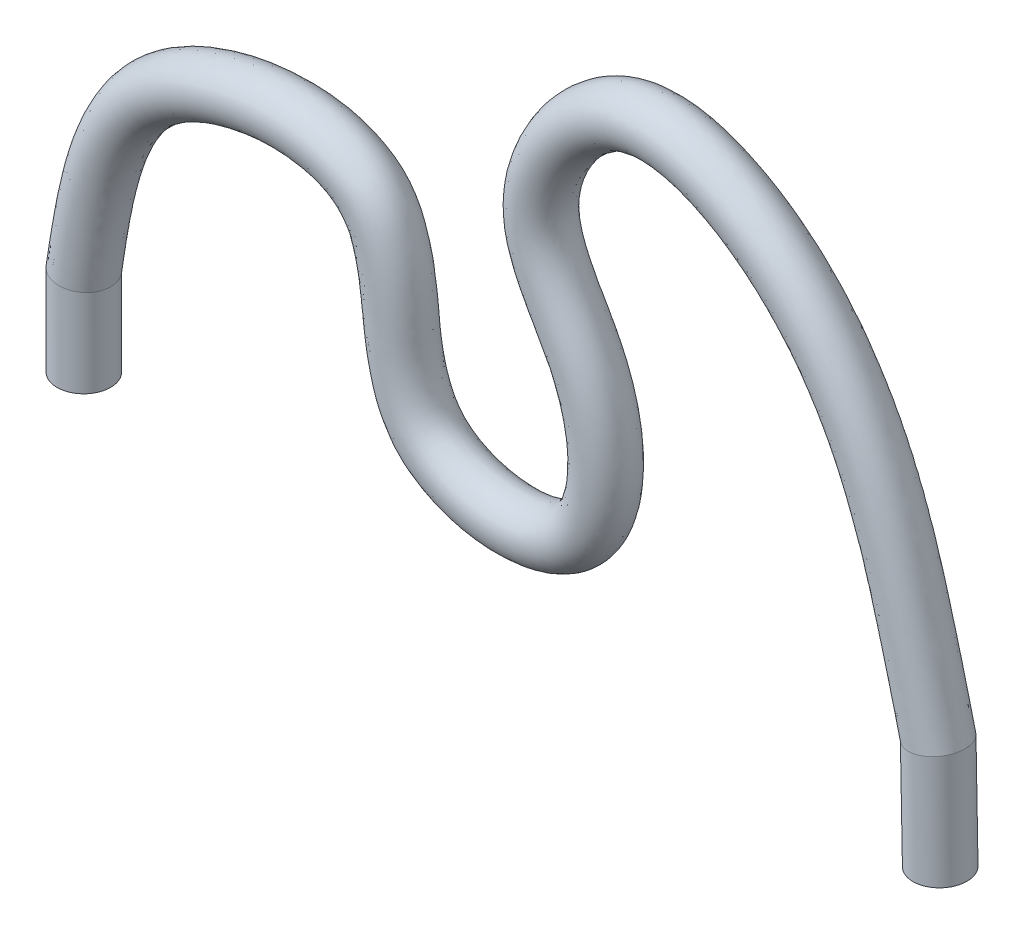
ISO-10303-21;
HEADER;
FILE_DESCRIPTION(('STEP AP214'),'2;1');
FILE_NAME('part.step','',(''),(''),'','','');
FILE_SCHEMA(('AUTOMOTIVE_DESIGN { 1 0 10303 214 1 1 1 1 }'));
ENDSEC;
DATA;
#1=APPLICATION_CONTEXT('core data for automotive mechanical design processes');
#2=APPLICATION_PROTOCOL_DEFINITION('international standard','automotive_design',2000,#1);
#3=PRODUCT_CONTEXT('',#1,'mechanical');
#4=PRODUCT('Part','Part','',(#3));
#5=PRODUCT_RELATED_PRODUCT_CATEGORY('part','',(#4));
#6=PRODUCT_DEFINITION_FORMATION('','',#4);
#7=PRODUCT_DEFINITION_CONTEXT('part definition',#1,'design');
#8=PRODUCT_DEFINITION('design','',#6,#7);
#9=PRODUCT_DEFINITION_SHAPE('','',#8);
#10=(LENGTH_UNIT() NAMED_UNIT(*) SI_UNIT(.MILLI.,.METRE.));
#11=(NAMED_UNIT(*) PLANE_ANGLE_UNIT() SI_UNIT($,.RADIAN.));
#12=(NAMED_UNIT(*) SI_UNIT($,.STERADIAN.) SOLID_ANGLE_UNIT());
#13=UNCERTAINTY_MEASURE_WITH_UNIT(LENGTH_MEASURE(1.E-05),#10,'distance_accuracy_value','');
#14=(GEOMETRIC_REPRESENTATION_CONTEXT(3) GLOBAL_UNCERTAINTY_ASSIGNED_CONTEXT((#13)) GLOBAL_UNIT_ASSIGNED_CONTEXT((#10,
#11,#12)) REPRESENTATION_CONTEXT('',''));
#15=CARTESIAN_POINT('',(0.,0.,0.));
#16=DIRECTION('',(0.,0.,1.));
#17=DIRECTION('',(1.,0.,0.));
#18=AXIS2_PLACEMENT_3D('',#15,#16,#17);
#19=CARTESIAN_POINT('',(0.,9.24264068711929,0.));
#20=DIRECTION('',(0.,-1.,0.));
#21=DIRECTION('',(0.,0.,-1.));
#22=AXIS2_PLACEMENT_3D('',#19,#20,#21);
#23=CYLINDRICAL_SURFACE('',#22,1.5);
#24=CARTESIAN_POINT('',(0.,0.,0.));
#25=DIRECTION('',(0.,1.,0.));
#26=DIRECTION('',(0.,0.,1.));
#27=AXIS2_PLACEMENT_3D('',#24,#25,#26);
#28=CIRCLE('',#27,1.5);
#29=CARTESIAN_POINT('',(0.,0.,1.5));
#30=VERTEX_POINT('',#29);
#31=EDGE_CURVE('E38',#30,#30,#28,.T.);
#32=ORIENTED_EDGE('',*,*,#31,.T.);
#33=EDGE_LOOP('',(#32));
#34=FACE_BOUND('',#33,.T.);
#35=CARTESIAN_POINT('',(0.,5.,0.));
#36=DIRECTION('',(0.077250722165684,0.997011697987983,1.10725308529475E-12));
#37=DIRECTION('',(0.997011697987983,-0.077250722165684,1.4290407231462E-11));
#38=AXIS2_PLACEMENT_3D('',#35,#36,#37);
#39=ELLIPSE('',#38,1.50449588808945,1.5);
#40=CARTESIAN_POINT('',(1.5,4.88377660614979,2.14998589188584E-11));
#41=VERTEX_POINT('',#40);
#42=EDGE_CURVE('E10',#41,#41,#39,.T.);
#43=ORIENTED_EDGE('',*,*,#42,.F.);
#44=EDGE_LOOP('',(#43));
#45=FACE_BOUND('',#44,.T.);
#46=ADVANCED_FACE('F32',(#34,#45),#23,.T.);
#47=CARTESIAN_POINT('',(0.,0.,0.));
#48=DIRECTION('',(0.,1.,0.));
#49=DIRECTION('',(0.,0.,1.));
#50=AXIS2_PLACEMENT_3D('',#47,#48,#49);
#51=PLANE('',#50);
#52=ORIENTED_EDGE('',*,*,#31,.F.);
#53=EDGE_LOOP('',(#52));
#54=FACE_BOUND('',#53,.T.);
#55=ADVANCED_FACE('F71',(#54),#51,.F.);
#56=CARTESIAN_POINT('',(1.5,4.88377660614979,2.1499857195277E-11));
#57=CARTESIAN_POINT('',(1.68845043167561,6.09256338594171,2.42009623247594E-11));
#58=CARTESIAN_POINT('',(2.02388261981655,8.23987835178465,2.90089991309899E-11));
#59=CARTESIAN_POINT('',(2.87452784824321,11.4569505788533,3.35033239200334E-11));
#60=CARTESIAN_POINT('',(4.08754802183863,13.6134177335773,3.18914864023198E-11));
#61=CARTESIAN_POINT('',(5.44150091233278,14.9232353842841,2.57810977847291E-11));
#62=CARTESIAN_POINT('',(6.72714814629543,15.7237421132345,2.00604814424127E-11));
#63=CARTESIAN_POINT('',(8.28750598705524,16.34284519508,1.38981100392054E-11));
#64=CARTESIAN_POINT('',(9.97967550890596,16.7348502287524,6.62248505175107E-12));
#65=CARTESIAN_POINT('',(11.6670654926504,16.8689144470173,-4.30864360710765E-13));
#66=CARTESIAN_POINT('',(13.0926747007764,16.7377407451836,-5.96067165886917E-12));
#67=CARTESIAN_POINT('',(14.1633938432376,16.4196495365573,-9.2173768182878E-12));
#68=CARTESIAN_POINT('',(14.8106001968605,16.0547323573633,-1.02283417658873E-11));
#69=CARTESIAN_POINT('',(15.2008527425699,15.6915305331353,-9.83360899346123E-12));
#70=CARTESIAN_POINT('',(15.4519486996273,15.3309117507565,-8.82226265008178E-12));
#71=CARTESIAN_POINT('',(16.1344398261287,13.8151733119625,-8.2068135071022E-13));
#72=CARTESIAN_POINT('',(16.1721154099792,11.2673680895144,1.03066857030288E-11));
#73=CARTESIAN_POINT('',(16.806127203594,8.40464694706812,3.69092365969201E-11));
#74=CARTESIAN_POINT('',(17.3847689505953,6.90976351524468,4.70055024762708E-11));
#75=CARTESIAN_POINT('',(18.4160634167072,5.4810622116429,5.6266341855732E-11));
#76=CARTESIAN_POINT('',(19.8248173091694,4.44777923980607,5.81593823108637E-11));
#77=CARTESIAN_POINT('',(21.3819709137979,3.77879269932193,5.75992743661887E-11));
#78=CARTESIAN_POINT('',(23.0410361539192,3.41257587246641,5.46570132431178E-11));
#79=CARTESIAN_POINT('',(24.7324129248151,3.34732920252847,5.06548743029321E-11));
#80=CARTESIAN_POINT('',(26.2324265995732,3.58027635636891,4.67882940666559E-11));
#81=CARTESIAN_POINT('',(27.4851292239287,4.04348391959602,4.38141793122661E-11));
#82=CARTESIAN_POINT('',(28.4855453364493,4.65312596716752,4.12661551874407E-11));
#83=CARTESIAN_POINT('',(29.3194293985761,5.47968645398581,4.08373495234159E-11));
#84=CARTESIAN_POINT('',(30.0046570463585,6.53460081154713,4.03962884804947E-11));
#85=CARTESIAN_POINT('',(30.488398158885,7.80234198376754,4.05928773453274E-11));
#86=CARTESIAN_POINT('',(30.7399086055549,9.23488361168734,4.12668110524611E-11));
#87=CARTESIAN_POINT('',(30.7952730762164,11.6502539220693,4.29250543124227E-11));
#88=CARTESIAN_POINT('',(29.974136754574,14.9217088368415,4.69507756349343E-11));
#89=CARTESIAN_POINT('',(28.3053896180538,17.5529562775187,4.46394222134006E-11));
#90=CARTESIAN_POINT('',(27.4418282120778,19.2733504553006,4.72740123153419E-11));
#91=CARTESIAN_POINT('',(27.1160883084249,20.3364801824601,4.71649527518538E-11));
#92=CARTESIAN_POINT('',(27.1011364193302,21.3463120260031,4.72033091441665E-11));
#93=CARTESIAN_POINT('',(27.4005104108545,22.5311416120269,4.70681406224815E-11));
#94=CARTESIAN_POINT('',(27.9841644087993,23.7255366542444,4.70137803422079E-11));
#95=CARTESIAN_POINT('',(28.7305118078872,24.7366992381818,4.69674665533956E-11));
#96=CARTESIAN_POINT('',(29.523286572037,25.5048645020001,4.69446127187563E-11));
#97=CARTESIAN_POINT('',(30.2825613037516,26.034969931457,4.69284612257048E-11));
#98=CARTESIAN_POINT('',(31.0316694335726,26.368540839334,4.69266216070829E-11));
#99=CARTESIAN_POINT('',(31.9064205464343,26.5488140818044,4.69506632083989E-11));
#100=CARTESIAN_POINT('',(32.9603928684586,26.5236330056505,4.69617287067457E-11));
#101=CARTESIAN_POINT('',(34.1931645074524,26.2261237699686,4.69713050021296E-11));
#102=CARTESIAN_POINT('',(36.790122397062,25.1138325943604,4.69815569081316E-11));
#103=CARTESIAN_POINT('',(40.2797569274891,22.1890259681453,4.70108052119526E-11));
#104=CARTESIAN_POINT('',(43.2205937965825,17.2341592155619,4.69940018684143E-11));
#105=CARTESIAN_POINT('',(45.0021261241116,11.5658507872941,4.68860344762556E-11));
#106=CARTESIAN_POINT('',(45.9058343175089,7.95338855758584,4.69106064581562E-11));
#107=CARTESIAN_POINT('',(46.3888395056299,6.0047459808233,4.69092625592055E-11));
#108=CARTESIAN_POINT('',(1.500000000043,4.88377660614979,-2.9999999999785));
#109=CARTESIAN_POINT('',(1.71874597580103,6.28688956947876,-2.99999999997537));
#110=CARTESIAN_POINT('',(2.01044382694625,8.1536772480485,-2.99999999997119));
#111=CARTESIAN_POINT('',(2.8779021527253,11.4785945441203,-2.99999999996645));
#112=CARTESIAN_POINT('',(4.08713683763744,13.6107802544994,-2.99999999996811));
#113=CARTESIAN_POINT('',(5.44158459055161,14.923772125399,-2.99999999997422));
#114=CARTESIAN_POINT('',(6.72712325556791,15.7235824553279,-2.99999999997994));
#115=CARTESIAN_POINT('',(8.28751307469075,16.3428906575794,-2.9999999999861));
#116=CARTESIAN_POINT('',(9.97967362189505,16.7348381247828,-2.99999999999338));
#117=CARTESIAN_POINT('',(11.6670659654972,16.8689174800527,-3.00000000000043));
#118=CARTESIAN_POINT('',(13.0926746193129,16.7377402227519,-3.00000000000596));
#119=CARTESIAN_POINT('',(14.1633938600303,16.4196496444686,-3.00000000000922));
#120=CARTESIAN_POINT('',(14.8106001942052,16.0547323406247,-3.00000000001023));
#121=CARTESIAN_POINT('',(15.2008527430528,15.6915305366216,-3.00000000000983));
#122=CARTESIAN_POINT('',(15.451948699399,15.3309117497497,-3.00000000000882));
#123=CARTESIAN_POINT('',(16.1344398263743,13.8151733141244,-3.00000000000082));
#124=CARTESIAN_POINT('',(16.1721154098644,11.267368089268,-2.9999999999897));
#125=CARTESIAN_POINT('',(16.8061272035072,8.40464694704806,-2.99999999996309));
#126=CARTESIAN_POINT('',(17.3847689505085,6.90976351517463,-2.999999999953));
#127=CARTESIAN_POINT('',(18.4160634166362,5.48106221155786,-2.99999999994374));
#128=CARTESIAN_POINT('',(19.8248173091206,4.44777923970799,-2.99999999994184));
#129=CARTESIAN_POINT('',(21.3819709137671,3.77879269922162,-2.9999999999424));
#130=CARTESIAN_POINT('',(23.0410361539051,3.41257587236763,-2.99999999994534));
#131=CARTESIAN_POINT('',(24.7324129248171,3.34732920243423,-2.99999999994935));
#132=CARTESIAN_POINT('',(26.2324265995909,3.58027635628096,-2.99999999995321));
#133=CARTESIAN_POINT('',(27.4851292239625,4.04348391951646,-2.99999999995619));
#134=CARTESIAN_POINT('',(28.4855453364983,4.65312596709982,-2.99999999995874));
#135=CARTESIAN_POINT('',(29.3194293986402,5.47968645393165,-2.99999999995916));
#136=CARTESIAN_POINT('',(30.0046570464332,6.53460081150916,-2.99999999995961));
#137=CARTESIAN_POINT('',(30.4883981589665,7.8023419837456,-2.99999999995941));
#138=CARTESIAN_POINT('',(30.7399086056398,9.23488361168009,-2.99999999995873));
#139=CARTESIAN_POINT('',(30.7952730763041,11.6502539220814,-2.99999999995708));
#140=CARTESIAN_POINT('',(29.9741367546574,14.9217088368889,-2.99999999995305));
#141=CARTESIAN_POINT('',(28.3053896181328,17.5529562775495,-2.99999999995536));
#142=CARTESIAN_POINT('',(27.441828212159,19.2733504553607,-2.99999999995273));
#143=CARTESIAN_POINT('',(27.1160883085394,20.3364801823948,-2.99999999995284));
#144=CARTESIAN_POINT('',(27.1011364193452,21.3463120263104,-2.9999999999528));
#145=CARTESIAN_POINT('',(27.4005104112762,22.5311416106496,-2.99999999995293));
#146=CARTESIAN_POINT('',(27.98416440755,23.7255366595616,-2.99999999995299));
#147=CARTESIAN_POINT('',(28.7305118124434,24.7366992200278,-2.99999999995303));
#148=CARTESIAN_POINT('',(29.5232865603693,25.5048645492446,-2.99999999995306));
#149=CARTESIAN_POINT('',(30.2825613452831,26.0349697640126,-2.99999999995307));
#150=CARTESIAN_POINT('',(31.0316692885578,26.3685414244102,-2.99999999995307));
#151=CARTESIAN_POINT('',(31.9064211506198,26.5488116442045,-2.99999999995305));
#152=CARTESIAN_POINT('',(32.9603896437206,26.5236460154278,-2.99999999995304));
#153=CARTESIAN_POINT('',(34.1931773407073,26.2260719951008,-2.99999999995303));
#154=CARTESIAN_POINT('',(36.790004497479,25.1143082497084,-2.99999999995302));
#155=CARTESIAN_POINT('',(40.2817699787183,22.1809044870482,-2.99999999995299));
#156=CARTESIAN_POINT('',(43.2139999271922,17.2607616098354,-2.99999999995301));
#157=CARTESIAN_POINT('',(45.0264929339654,11.4675450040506,-2.99999999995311));
#158=CARTESIAN_POINT('',(45.8528532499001,8.16713608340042,-2.99999999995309));
#159=CARTESIAN_POINT('',(46.3888395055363,6.00474598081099,-2.99999999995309));
#160=CARTESIAN_POINT('',(-1.499999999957,5.11622339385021,-3.0000000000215));
#161=CARTESIAN_POINT('',(-1.28125402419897,6.51933635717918,-3.00000000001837));
#162=CARTESIAN_POINT('',(-0.923348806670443,8.81383220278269,-3.00000000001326));
#163=CARTESIAN_POINT('',(0.0244651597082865,12.4851716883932,-3.00000000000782));
#164=CARTESIAN_POINT('',(1.62695887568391,15.411601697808,-3.00000000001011));
#165=CARTESIAN_POINT('',(3.58880761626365,17.3127185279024,-3.00000000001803));
#166=CARTESIAN_POINT('',(5.4083971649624,18.4368422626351,-3.00000000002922));
#167=CARTESIAN_POINT('',(7.39805917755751,19.2182537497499,-3.00000000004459));
#168=CARTESIAN_POINT('',(9.51255392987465,19.7094006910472,-3.00000000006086));
#169=CARTESIAN_POINT('',(11.6560054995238,19.8820214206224,-3.00000000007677));
#170=CARTESIAN_POINT('',(13.598939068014,19.7144635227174,-3.00000000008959));
#171=CARTESIAN_POINT('',(15.282893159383,19.2274651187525,-3.00000000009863));
#172=CARTESIAN_POINT('',(16.5324498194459,18.5491750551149,-3.0000000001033));
#173=CARTESIAN_POINT('',(17.4791873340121,17.6818610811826,-3.00000000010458));
#174=CARTESIAN_POINT('',(18.1077273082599,16.7679954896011,-3.00000000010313));
#175=CARTESIAN_POINT('',(19.3023723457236,13.9816355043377,-3.00000000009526));
#176=CARTESIAN_POINT('',(19.1784032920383,11.4585618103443,-3.00000000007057));
#177=CARTESIAN_POINT('',(19.6987864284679,9.24328497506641,-3.00000000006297));
#178=CARTESIAN_POINT('',(20.0752155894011,8.31392116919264,-3.00000000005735));
#179=CARTESIAN_POINT('',(20.5597089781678,7.64788716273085,-3.00000000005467));
#180=CARTESIAN_POINT('',(21.2983242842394,7.09141714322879,-3.00000000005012));
#181=CARTESIAN_POINT('',(22.2975136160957,6.65338669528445,-3.0000000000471));
#182=CARTESIAN_POINT('',(23.4256794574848,6.40388758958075,-3.00000000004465));
#183=CARTESIAN_POINT('',(24.57379142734,6.36143405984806,-3.00000000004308));
#184=CARTESIAN_POINT('',(25.5115099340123,6.51300307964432,-3.00000000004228));
#185=CARTESIAN_POINT('',(26.1883341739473,6.76997629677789,-3.00000000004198));
#186=CARTESIAN_POINT('',(26.6255133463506,7.04114382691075,-3.0000000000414));
#187=CARTESIAN_POINT('',(26.9654581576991,7.37716323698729,-3.00000000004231));
#188=CARTESIAN_POINT('',(27.2961382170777,7.87566209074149,-3.00000000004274));
#189=CARTESIAN_POINT('',(27.5731092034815,8.58423351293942,-3.00000000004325));
#190=CARTESIAN_POINT('',(27.7421969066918,9.51278307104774,-3.00000000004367));
#191=CARTESIAN_POINT('',(27.7804198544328,11.2415356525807,-3.00000000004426));
#192=CARTESIAN_POINT('',(27.2283574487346,13.6195540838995,-3.00000000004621));
#193=CARTESIAN_POINT('',(25.7675912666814,15.9469951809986,-3.00000000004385));
#194=CARTESIAN_POINT('',(24.6787218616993,18.0736164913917,-3.00000000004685));
#195=CARTESIAN_POINT('',(24.1204416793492,19.7939456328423,-3.00000000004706));
#196=CARTESIAN_POINT('',(24.0922024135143,21.7943107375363,-3.00000000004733));
#197=CARTESIAN_POINT('',(24.579829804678,23.5971575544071,-3.00000000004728));
#198=CARTESIAN_POINT('',(25.4081605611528,25.2961601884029,-3.00000000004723));
#199=CARTESIAN_POINT('',(26.4459264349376,26.7020782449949,-3.00000000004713));
#200=CARTESIAN_POINT('',(27.5921562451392,27.8157068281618,-3.00000000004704));
#201=CARTESIAN_POINT('',(28.7601651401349,28.6423643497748,-3.00000000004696));
#202=CARTESIAN_POINT('',(30.1075054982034,29.2485383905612,-3.00000000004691));
#203=CARTESIAN_POINT('',(31.6797982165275,29.5676985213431,-3.00000000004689));
#204=CARTESIAN_POINT('',(33.3980735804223,29.5139413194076,-3.00000000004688));
#205=CARTESIAN_POINT('',(35.1729827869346,29.0759036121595,-3.00000000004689));
#206=CARTESIAN_POINT('',(38.5697119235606,27.6063603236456,-3.00000000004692));
#207=CARTESIAN_POINT('',(42.5745966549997,24.1973490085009,-3.00000000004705));
#208=CARTESIAN_POINT('',(46.0404949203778,18.3463181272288,-3.00000000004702));
#209=CARTESIAN_POINT('',(47.8833582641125,12.3933322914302,-3.00000000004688));
#210=CARTESIAN_POINT('',(48.8460968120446,8.56065387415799,-3.00000000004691));
#211=CARTESIAN_POINT('',(49.3820830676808,6.39826377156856,-3.00000000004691));
#212=CARTESIAN_POINT('',(-1.5,5.11622339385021,-2.15000408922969E-11));
#213=CARTESIAN_POINT('',(-1.29640179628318,6.42217326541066,-1.85818191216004E-11));
#214=CARTESIAN_POINT('',(-0.916629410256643,8.85693275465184,-1.31581993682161E-11));
#215=CARTESIAN_POINT('',(0.0227780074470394,12.474349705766,-7.83938557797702E-12));
#216=CARTESIAN_POINT('',(1.6271644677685,15.4129204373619,-1.01039175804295E-11));
#217=CARTESIAN_POINT('',(3.58876577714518,17.312450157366,-1.80256408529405E-11));
#218=CARTESIAN_POINT('',(5.4084096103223,18.4369220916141,-2.92186788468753E-11));
#219=CARTESIAN_POINT('',(7.39805563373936,19.2182310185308,-4.45926178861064E-11));
#220=CARTESIAN_POINT('',(9.51255487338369,19.7094067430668,-6.08589096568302E-11));
#221=CARTESIAN_POINT('',(11.6560052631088,19.882019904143,-7.67708231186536E-11));
#222=CARTESIAN_POINT('',(13.5989391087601,19.7144637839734,-8.95928414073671E-11));
#223=CARTESIAN_POINT('',(15.2828931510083,19.2274650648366,-9.86320793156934E-11));
#224=CARTESIAN_POINT('',(16.5324498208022,18.5491750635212,-1.03297908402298E-10));
#225=CARTESIAN_POINT('',(17.4791873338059,17.6818610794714,-1.04581022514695E-10));
#226=CARTESIAN_POINT('',(18.1077273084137,16.7679954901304,-1.03132012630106E-10));
#227=CARTESIAN_POINT('',(19.3023723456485,13.9816355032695,-9.52554593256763E-11));
#228=CARTESIAN_POINT('',(19.1784032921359,11.4585618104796,-7.05675684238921E-11));
#229=CARTESIAN_POINT('',(19.6987864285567,9.24328497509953,-6.29689668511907E-11));
#230=CARTESIAN_POINT('',(20.0752155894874,8.31392116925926,-5.73437784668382E-11));
#231=CARTESIAN_POINT('',(20.559708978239,7.64788716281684,-5.46740069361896E-11));
#232=CARTESIAN_POINT('',(21.2983242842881,7.09141714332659,-5.01140642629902E-11));
#233=CARTESIAN_POINT('',(22.2975136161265,6.65338669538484,-4.71016484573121E-11));
#234=CARTESIAN_POINT('',(23.4256794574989,6.40388758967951,-4.46544698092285E-11));
#235=CARTESIAN_POINT('',(24.5737914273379,6.36143405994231,-4.30823074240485E-11));
#236=CARTESIAN_POINT('',(25.5115099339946,6.51300307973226,-4.22764210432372E-11));
#237=CARTESIAN_POINT('',(26.1883341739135,6.76997629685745,-4.1982559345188E-11));
#238=CARTESIAN_POINT('',(26.6255133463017,7.04114382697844,-4.13974998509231E-11));
#239=CARTESIAN_POINT('',(26.965458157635,7.37716323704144,-4.23060999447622E-11));
#240=CARTESIAN_POINT('',(27.296138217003,7.87566209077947,-4.27429665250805E-11));
#241=CARTESIAN_POINT('',(27.5731092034,8.58423351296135,-4.32473344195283E-11));
#242=CARTESIAN_POINT('',(27.7421969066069,9.51278307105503,-4.36673308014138E-11));
#243=CARTESIAN_POINT('',(27.7804198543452,11.2415356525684,-4.42626526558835E-11));
#244=CARTESIAN_POINT('',(27.2283574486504,13.6195540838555,-4.62147961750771E-11));
#245=CARTESIAN_POINT('',(25.7675912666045,15.9469951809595,-4.38499629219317E-11));
#246=CARTESIAN_POINT('',(24.6787218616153,18.0736164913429,-4.68485960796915E-11));
#247=CARTESIAN_POINT('',(24.1204416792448,19.7939456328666,-4.7062266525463E-11));
#248=CARTESIAN_POINT('',(24.0922024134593,21.7943107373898,-4.73283437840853E-11));
#249=CARTESIAN_POINT('',(24.5798298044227,23.5971575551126,-4.72770202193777E-11));
#250=CARTESIAN_POINT('',(25.408160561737,25.2961601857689,-4.72265014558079E-11));
#251=CARTESIAN_POINT('',(26.4459264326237,26.7020782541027,-4.71303888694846E-11));
#252=CARTESIAN_POINT('',(27.5921562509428,27.8157068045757,-4.7041781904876E-11));
#253=CARTESIAN_POINT('',(28.7601651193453,28.6423644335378,-4.6962719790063E-11));
#254=CARTESIAN_POINT('',(30.1075055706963,29.2485380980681,-4.6907301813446E-11));
#255=CARTESIAN_POINT('',(31.6797979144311,29.5676997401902,-4.68923715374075E-11));
#256=CARTESIAN_POINT('',(33.3980751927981,29.5139348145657,-4.68820628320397E-11));
#257=CARTESIAN_POINT('',(35.1729763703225,29.075929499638,-4.68893278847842E-11));
#258=CARTESIAN_POINT('',(38.56977087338,27.6061224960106,-4.69250018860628E-11));
#259=CARTESIAN_POINT('',(42.573590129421,24.2014097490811,-4.70452106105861E-11));
#260=CARTESIAN_POINT('',(46.0437918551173,18.3330169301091,-4.70171266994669E-11));
#261=CARTESIAN_POINT('',(47.8711748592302,12.4424851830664,-4.68768730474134E-11));
#262=CARTESIAN_POINT('',(48.8725873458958,8.45378011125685,-4.69080286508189E-11));
#263=CARTESIAN_POINT('',(49.3820830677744,6.39826377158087,-4.69094462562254E-11));
#264=CARTESIAN_POINT('',(-1.500000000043,5.11622339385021,2.9999999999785));
#265=CARTESIAN_POINT('',(-1.31154956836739,6.32501017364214,2.9999999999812));
#266=CARTESIAN_POINT('',(-0.909910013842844,8.90003330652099,2.99999999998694));
#267=CARTESIAN_POINT('',(0.0210908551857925,12.4635277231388,2.99999999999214));
#268=CARTESIAN_POINT('',(1.6273700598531,15.4142391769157,2.9999999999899));
#269=CARTESIAN_POINT('',(3.5887239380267,17.3121817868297,2.99999999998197));
#270=CARTESIAN_POINT('',(5.40842205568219,18.4370019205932,2.99999999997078));
#271=CARTESIAN_POINT('',(7.39805208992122,19.2182082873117,2.99999999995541));
#272=CARTESIAN_POINT('',(9.51255581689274,19.7094127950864,2.99999999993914));
#273=CARTESIAN_POINT('',(11.6560050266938,19.8820183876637,2.99999999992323));
#274=CARTESIAN_POINT('',(13.5989391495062,19.7144640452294,2.99999999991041));
#275=CARTESIAN_POINT('',(15.2828931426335,19.2274650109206,2.99999999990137));
#276=CARTESIAN_POINT('',(16.5324498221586,18.5491750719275,2.9999999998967));
#277=CARTESIAN_POINT('',(17.4791873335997,17.6818610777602,2.99999999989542));
#278=CARTESIAN_POINT('',(18.1077273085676,16.7679954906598,2.99999999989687));
#279=CARTESIAN_POINT('',(19.3023723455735,13.9816355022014,2.99999999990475));
#280=CARTESIAN_POINT('',(19.1784032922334,11.4585618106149,2.99999999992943));
#281=CARTESIAN_POINT('',(19.6987864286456,9.24328497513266,2.99999999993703));
#282=CARTESIAN_POINT('',(20.0752155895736,8.31392116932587,2.99999999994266));
#283=CARTESIAN_POINT('',(20.5597089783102,7.64788716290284,2.99999999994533));
#284=CARTESIAN_POINT('',(21.2983242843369,7.0914171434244,2.99999999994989));
#285=CARTESIAN_POINT('',(22.2975136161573,6.65338669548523,2.9999999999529));
#286=CARTESIAN_POINT('',(23.425679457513,6.40388758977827,2.99999999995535));
#287=CARTESIAN_POINT('',(24.5737914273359,6.36143406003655,2.99999999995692));
#288=CARTESIAN_POINT('',(25.5115099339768,6.51300307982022,2.99999999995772));
#289=CARTESIAN_POINT('',(26.1883341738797,6.769976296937,2.99999999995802));
#290=CARTESIAN_POINT('',(26.6255133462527,7.04114382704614,2.9999999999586));
#291=CARTESIAN_POINT('',(26.9654581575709,7.3771632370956,2.99999999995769));
#292=CARTESIAN_POINT('',(27.2961382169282,7.87566209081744,2.99999999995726));
#293=CARTESIAN_POINT('',(27.5731092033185,8.58423351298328,2.99999999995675));
#294=CARTESIAN_POINT('',(27.7421969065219,9.51278307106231,2.99999999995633));
#295=CARTESIAN_POINT('',(27.7804198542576,11.241535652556,2.99999999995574));
#296=CARTESIAN_POINT('',(27.2283574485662,13.6195540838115,2.99999999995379));
#297=CARTESIAN_POINT('',(25.7675912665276,15.9469951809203,2.99999999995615));
#298=CARTESIAN_POINT('',(24.6787218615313,18.0736164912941,2.99999999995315));
#299=CARTESIAN_POINT('',(24.1204416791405,19.7939456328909,2.99999999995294));
#300=CARTESIAN_POINT('',(24.0922024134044,21.7943107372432,2.99999999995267));
#301=CARTESIAN_POINT('',(24.5798298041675,23.5971575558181,2.99999999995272));
#302=CARTESIAN_POINT('',(25.4081605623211,25.2961601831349,2.99999999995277));
#303=CARTESIAN_POINT('',(26.4459264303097,26.7020782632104,2.99999999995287));
#304=CARTESIAN_POINT('',(27.5921562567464,27.8157067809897,2.99999999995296));
#305=CARTESIAN_POINT('',(28.7601650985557,28.6423645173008,2.99999999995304));
#306=CARTESIAN_POINT('',(30.1075056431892,29.248537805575,2.99999999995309));
#307=CARTESIAN_POINT('',(31.6797976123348,29.5677009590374,2.99999999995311));
#308=CARTESIAN_POINT('',(33.398076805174,29.5139283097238,2.99999999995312));
#309=CARTESIAN_POINT('',(35.1729699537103,29.0759553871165,2.99999999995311));
#310=CARTESIAN_POINT('',(38.5698298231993,27.6058846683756,2.99999999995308));
#311=CARTESIAN_POINT('',(42.5725836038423,24.2054704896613,2.99999999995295));
#312=CARTESIAN_POINT('',(46.0470887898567,18.3197157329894,2.99999999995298));
#313=CARTESIAN_POINT('',(47.858991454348,12.4916380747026,2.99999999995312));
#314=CARTESIAN_POINT('',(48.899077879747,8.34690634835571,2.99999999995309));
#315=CARTESIAN_POINT('',(49.382083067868,6.39826377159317,2.99999999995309));
#316=CARTESIAN_POINT('',(1.499999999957,4.88377660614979,3.0000000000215));
#317=CARTESIAN_POINT('',(1.6581548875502,5.89823720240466,3.00000000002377));
#318=CARTESIAN_POINT('',(2.03732141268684,8.32607945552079,3.0000000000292));
#319=CARTESIAN_POINT('',(2.87115354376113,11.4353066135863,3.00000000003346));
#320=CARTESIAN_POINT('',(4.08795920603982,13.6160552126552,3.0000000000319));
#321=CARTESIAN_POINT('',(5.44141723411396,14.9226986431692,3.00000000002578));
#322=CARTESIAN_POINT('',(6.72717303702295,15.723901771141,3.00000000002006));
#323=CARTESIAN_POINT('',(8.28749889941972,16.3427997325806,3.0000000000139));
#324=CARTESIAN_POINT('',(9.97967739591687,16.734862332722,3.00000000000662));
#325=CARTESIAN_POINT('',(11.6670650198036,16.8689114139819,2.99999999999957));
#326=CARTESIAN_POINT('',(13.09267478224,16.7377412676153,2.99999999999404));
#327=CARTESIAN_POINT('',(14.1633938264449,16.419649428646,2.99999999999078));
#328=CARTESIAN_POINT('',(14.8106001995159,16.0547323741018,2.99999999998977));
#329=CARTESIAN_POINT('',(15.200852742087,15.6915305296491,2.99999999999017));
#330=CARTESIAN_POINT('',(15.4519486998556,15.3309117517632,2.99999999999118));
#331=CARTESIAN_POINT('',(16.1344398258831,13.8151733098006,2.99999999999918));
#332=CARTESIAN_POINT('',(16.1721154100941,11.2673680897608,3.00000000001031));
#333=CARTESIAN_POINT('',(16.8061272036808,8.40464694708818,3.00000000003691));
#334=CARTESIAN_POINT('',(17.3847689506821,6.90976351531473,3.00000000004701));
#335=CARTESIAN_POINT('',(18.4160634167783,5.48106221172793,3.00000000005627));
#336=CARTESIAN_POINT('',(19.8248173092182,4.44777923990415,3.00000000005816));
#337=CARTESIAN_POINT('',(21.3819709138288,3.77879269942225,3.0000000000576));
#338=CARTESIAN_POINT('',(23.0410361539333,3.41257587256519,3.00000000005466));
#339=CARTESIAN_POINT('',(24.7324129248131,3.34732920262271,3.00000000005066));
#340=CARTESIAN_POINT('',(26.2324265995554,3.58027635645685,3.00000000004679));
#341=CARTESIAN_POINT('',(27.4851292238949,4.04348391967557,3.00000000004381));
#342=CARTESIAN_POINT('',(28.4855453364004,4.65312596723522,3.00000000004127));
#343=CARTESIAN_POINT('',(29.319429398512,5.47968645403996,3.00000000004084));
#344=CARTESIAN_POINT('',(30.0046570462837,6.53460081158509,3.0000000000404));
#345=CARTESIAN_POINT('',(30.4883981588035,7.80234198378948,3.00000000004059));
#346=CARTESIAN_POINT('',(30.73990860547,9.23488361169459,3.00000000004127));
#347=CARTESIAN_POINT('',(30.7952730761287,11.6502539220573,3.00000000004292));
#348=CARTESIAN_POINT('',(29.9741367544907,14.9217088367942,3.00000000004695));
#349=CARTESIAN_POINT('',(28.3053896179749,17.552956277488,3.00000000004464));
#350=CARTESIAN_POINT('',(27.4418282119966,19.2733504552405,3.00000000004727));
#351=CARTESIAN_POINT('',(27.1160883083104,20.3364801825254,3.00000000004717));
#352=CARTESIAN_POINT('',(27.1011364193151,21.3463120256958,3.0000000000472));
#353=CARTESIAN_POINT('',(27.4005104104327,22.5311416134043,3.00000000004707));
#354=CARTESIAN_POINT('',(27.9841644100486,23.7255366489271,3.00000000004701));
#355=CARTESIAN_POINT('',(28.730511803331,24.7366992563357,3.00000000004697));
#356=CARTESIAN_POINT('',(29.5232865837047,25.5048644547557,3.00000000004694));
#357=CARTESIAN_POINT('',(30.2825612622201,26.0349700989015,3.00000000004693));
#358=CARTESIAN_POINT('',(31.0316695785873,26.3685402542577,3.00000000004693));
#359=CARTESIAN_POINT('',(31.9064199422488,26.5488165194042,3.00000000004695));
#360=CARTESIAN_POINT('',(32.9603960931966,26.5236199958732,3.00000000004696));
#361=CARTESIAN_POINT('',(34.1931516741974,26.2261755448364,3.00000000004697));
#362=CARTESIAN_POINT('',(36.7902402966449,25.1133569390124,3.00000000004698));
#363=CARTESIAN_POINT('',(40.2777438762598,22.1971474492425,3.00000000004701));
#364=CARTESIAN_POINT('',(43.2271876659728,17.2075568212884,3.00000000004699));
#365=CARTESIAN_POINT('',(44.9777593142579,11.6641565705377,3.00000000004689));
#366=CARTESIAN_POINT('',(45.9588153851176,7.73964103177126,3.00000000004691));
#367=CARTESIAN_POINT('',(46.3888395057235,6.0047459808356,3.00000000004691));
#368=CARTESIAN_POINT('',(1.5,4.88377660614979,2.1499857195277E-11));
#369=CARTESIAN_POINT('',(1.68845043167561,6.09256338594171,2.42009623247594E-11));
#370=CARTESIAN_POINT('',(2.02388261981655,8.23987835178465,2.90089991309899E-11));
#371=CARTESIAN_POINT('',(2.87452784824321,11.4569505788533,3.35033239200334E-11));
#372=CARTESIAN_POINT('',(4.08754802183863,13.6134177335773,3.18914864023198E-11));
#373=CARTESIAN_POINT('',(5.44150091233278,14.9232353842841,2.57810977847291E-11));
#374=CARTESIAN_POINT('',(6.72714814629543,15.7237421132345,2.00604814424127E-11));
#375=CARTESIAN_POINT('',(8.28750598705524,16.34284519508,1.38981100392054E-11));
#376=CARTESIAN_POINT('',(9.97967550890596,16.7348502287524,6.62248505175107E-12));
#377=CARTESIAN_POINT('',(11.6670654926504,16.8689144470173,-4.30864360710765E-13));
#378=CARTESIAN_POINT('',(13.0926747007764,16.7377407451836,-5.96067165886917E-12));
#379=CARTESIAN_POINT('',(14.1633938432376,16.4196495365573,-9.2173768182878E-12));
#380=CARTESIAN_POINT('',(14.8106001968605,16.0547323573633,-1.02283417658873E-11));
#381=CARTESIAN_POINT('',(15.2008527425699,15.6915305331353,-9.83360899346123E-12));
#382=CARTESIAN_POINT('',(15.4519486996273,15.3309117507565,-8.82226265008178E-12));
#383=CARTESIAN_POINT('',(16.1344398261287,13.8151733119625,-8.2068135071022E-13));
#384=CARTESIAN_POINT('',(16.1721154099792,11.2673680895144,1.03066857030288E-11));
#385=CARTESIAN_POINT('',(16.806127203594,8.40464694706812,3.69092365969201E-11));
#386=CARTESIAN_POINT('',(17.3847689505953,6.90976351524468,4.70055024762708E-11));
#387=CARTESIAN_POINT('',(18.4160634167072,5.4810622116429,5.6266341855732E-11));
#388=CARTESIAN_POINT('',(19.8248173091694,4.44777923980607,5.81593823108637E-11));
#389=CARTESIAN_POINT('',(21.3819709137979,3.77879269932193,5.75992743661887E-11));
#390=CARTESIAN_POINT('',(23.0410361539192,3.41257587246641,5.46570132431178E-11));
#391=CARTESIAN_POINT('',(24.7324129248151,3.34732920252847,5.06548743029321E-11));
#392=CARTESIAN_POINT('',(26.2324265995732,3.58027635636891,4.67882940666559E-11));
#393=CARTESIAN_POINT('',(27.4851292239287,4.04348391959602,4.38141793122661E-11));
#394=CARTESIAN_POINT('',(28.4855453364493,4.65312596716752,4.12661551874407E-11));
#395=CARTESIAN_POINT('',(29.3194293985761,5.47968645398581,4.08373495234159E-11));
#396=CARTESIAN_POINT('',(30.0046570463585,6.53460081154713,4.03962884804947E-11));
#397=CARTESIAN_POINT('',(30.488398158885,7.80234198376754,4.05928773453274E-11));
#398=CARTESIAN_POINT('',(30.7399086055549,9.23488361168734,4.12668110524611E-11));
#399=CARTESIAN_POINT('',(30.7952730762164,11.6502539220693,4.29250543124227E-11));
#400=CARTESIAN_POINT('',(29.974136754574,14.9217088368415,4.69507756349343E-11));
#401=CARTESIAN_POINT('',(28.3053896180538,17.5529562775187,4.46394222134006E-11));
#402=CARTESIAN_POINT('',(27.4418282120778,19.2733504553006,4.72740123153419E-11));
#403=CARTESIAN_POINT('',(27.1160883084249,20.3364801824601,4.71649527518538E-11));
#404=CARTESIAN_POINT('',(27.1011364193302,21.3463120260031,4.72033091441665E-11));
#405=CARTESIAN_POINT('',(27.4005104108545,22.5311416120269,4.70681406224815E-11));
#406=CARTESIAN_POINT('',(27.9841644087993,23.7255366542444,4.70137803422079E-11));
#407=CARTESIAN_POINT('',(28.7305118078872,24.7366992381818,4.69674665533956E-11));
#408=CARTESIAN_POINT('',(29.523286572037,25.5048645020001,4.69446127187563E-11));
#409=CARTESIAN_POINT('',(30.2825613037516,26.034969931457,4.69284612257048E-11));
#410=CARTESIAN_POINT('',(31.0316694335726,26.368540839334,4.69266216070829E-11));
#411=CARTESIAN_POINT('',(31.9064205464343,26.5488140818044,4.69506632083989E-11));
#412=CARTESIAN_POINT('',(32.9603928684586,26.5236330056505,4.69617287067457E-11));
#413=CARTESIAN_POINT('',(34.1931645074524,26.2261237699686,4.69713050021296E-11));
#414=CARTESIAN_POINT('',(36.790122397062,25.1138325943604,4.69815569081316E-11));
#415=CARTESIAN_POINT('',(40.2797569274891,22.1890259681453,4.70108052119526E-11));
#416=CARTESIAN_POINT('',(43.2205937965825,17.2341592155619,4.69940018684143E-11));
#417=CARTESIAN_POINT('',(45.0021261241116,11.5658507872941,4.68860344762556E-11));
#418=CARTESIAN_POINT('',(45.9058343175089,7.95338855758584,4.69106064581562E-11));
#419=CARTESIAN_POINT('',(46.3888395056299,6.0047459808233,4.69092625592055E-11));
#420=(BOUNDED_SURFACE() B_SPLINE_SURFACE(3,3,((#56,#57,#58,#59,#60,#61,#62,#63,#64,#65,#66,#67,
#68,#69,#70,#71,#72,#73,#74,#75,#76,#77,#78,#79,#80,#81,#82,#83,#84,#85,#86,#87,#88,#89,#90,#91,
#92,#93,#94,#95,#96,#97,#98,#99,#100,#101,#102,#103,#104,#105,#106,#107),(#108,#109,#110,#111,
#112,#113,#114,#115,#116,#117,#118,#119,#120,#121,#122,#123,#124,#125,#126,#127,#128,#129,#130,
#131,#132,#133,#134,#135,#136,#137,#138,#139,#140,#141,#142,#143,#144,#145,#146,#147,#148,#149,
#150,#151,#152,#153,#154,#155,#156,#157,#158,#159),(#160,#161,#162,#163,#164,#165,#166,#167,
#168,#169,#170,#171,#172,#173,#174,#175,#176,#177,#178,#179,#180,#181,#182,#183,#184,#185,#186,
#187,#188,#189,#190,#191,#192,#193,#194,#195,#196,#197,#198,#199,#200,#201,#202,#203,#204,#205,
#206,#207,#208,#209,#210,#211),(#212,#213,#214,#215,#216,#217,#218,#219,#220,#221,#222,#223,
#224,#225,#226,#227,#228,#229,#230,#231,#232,#233,#234,#235,#236,#237,#238,#239,#240,#241,#242,
#243,#244,#245,#246,#247,#248,#249,#250,#251,#252,#253,#254,#255,#256,#257,#258,#259,#260,#261,
#262,#263),(#264,#265,#266,#267,#268,#269,#270,#271,#272,#273,#274,#275,#276,#277,#278,#279,
#280,#281,#282,#283,#284,#285,#286,#287,#288,#289,#290,#291,#292,#293,#294,#295,#296,#297,#298,
#299,#300,#301,#302,#303,#304,#305,#306,#307,#308,#309,#310,#311,#312,#313,#314,#315),(#316,
#317,#318,#319,#320,#321,#322,#323,#324,#325,#326,#327,#328,#329,#330,#331,#332,#333,#334,#335,
#336,#337,#338,#339,#340,#341,#342,#343,#344,#345,#346,#347,#348,#349,#350,#351,#352,#353,#354,
#355,#356,#357,#358,#359,#360,#361,#362,#363,#364,#365,#366,#367),(#368,#369,#370,#371,#372,
#373,#374,#375,#376,#377,#378,#379,#380,#381,#382,#383,#384,#385,#386,#387,#388,#389,#390,#391,
#392,#393,#394,#395,#396,#397,#398,#399,#400,#401,#402,#403,#404,#405,#406,#407,#408,#409,#410,
#411,#412,#413,#414,#415,#416,#417,#418,#419)),.UNSPECIFIED.,.T.,.F.,
.F.) B_SPLINE_SURFACE_WITH_KNOTS((4,3,4),(4,1,1,1,1,1,1,1,1,1,1,1,1,1,1,1,1,1,1,1,1,1,1,1,1,1,1,
1,1,1,1,1,1,1,1,1,1,1,1,1,1,1,1,1,1,1,1,1,1,4),(0.,0.5,1.),(0.,0.0367200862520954,
0.0717384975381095,0.104717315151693,0.121397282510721,0.139174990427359,0.158260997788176,
0.177879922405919,0.197130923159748,0.215176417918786,0.227568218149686,0.238926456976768,
0.246094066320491,0.253238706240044,0.260736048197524,0.313762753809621,0.327494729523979,
0.340867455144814,0.354189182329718,0.368034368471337,0.3825055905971,0.397345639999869,
0.412124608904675,0.426421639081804,0.435574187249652,0.444439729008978,0.453126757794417,
0.461834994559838,0.473753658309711,0.486170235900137,0.499026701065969,0.537778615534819,
0.573625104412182,0.588192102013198,0.601970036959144,0.615882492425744,0.630946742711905,
0.646892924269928,0.663107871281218,0.675056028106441,0.686554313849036,0.697490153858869,
0.708132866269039,0.722523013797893,0.737605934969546,0.753479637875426,0.819069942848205,
0.879686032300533,0.939593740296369,1.),
.UNSPECIFIED.) GEOMETRIC_REPRESENTATION_ITEM() RATIONAL_B_SPLINE_SURFACE(((1.,1.,1.,1.,1.,1.,1.,
1.,1.,1.,1.,1.,1.,1.,1.,1.,1.,1.,1.,1.,1.,1.,1.,1.,1.,1.,1.,1.,1.,1.,1.,1.,1.,1.,1.,1.,1.,1.,1.,
1.,1.,1.,1.,1.,1.,1.,1.,1.,1.,1.,1.,1.),(0.333333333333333,0.333333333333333,0.333333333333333,
0.333333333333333,0.333333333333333,0.333333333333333,0.333333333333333,0.333333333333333,
0.333333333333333,0.333333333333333,0.333333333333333,0.333333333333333,0.333333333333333,
0.333333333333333,0.333333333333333,0.333333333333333,0.333333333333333,0.333333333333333,
0.333333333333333,0.333333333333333,0.333333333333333,0.333333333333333,0.333333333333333,
0.333333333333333,0.333333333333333,0.333333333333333,0.333333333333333,0.333333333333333,
0.333333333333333,0.333333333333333,0.333333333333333,0.333333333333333,0.333333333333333,
0.333333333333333,0.333333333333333,0.333333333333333,0.333333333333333,0.333333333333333,
0.333333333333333,0.333333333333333,0.333333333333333,0.333333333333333,0.333333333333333,
0.333333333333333,0.333333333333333,0.333333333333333,0.333333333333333,0.333333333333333,
0.333333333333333,0.333333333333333,0.333333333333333,0.333333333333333),(0.333333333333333,
0.333333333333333,0.333333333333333,0.333333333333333,0.333333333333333,0.333333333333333,
0.333333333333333,0.333333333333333,0.333333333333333,0.333333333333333,0.333333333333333,
0.333333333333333,0.333333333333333,0.333333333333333,0.333333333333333,0.333333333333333,
0.333333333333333,0.333333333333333,0.333333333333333,0.333333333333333,0.333333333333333,
0.333333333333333,0.333333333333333,0.333333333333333,0.333333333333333,0.333333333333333,
0.333333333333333,0.333333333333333,0.333333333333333,0.333333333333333,0.333333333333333,
0.333333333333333,0.333333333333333,0.333333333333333,0.333333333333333,0.333333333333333,
0.333333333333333,0.333333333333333,0.333333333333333,0.333333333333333,0.333333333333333,
0.333333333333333,0.333333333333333,0.333333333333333,0.333333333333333,0.333333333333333,
0.333333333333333,0.333333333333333,0.333333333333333,0.333333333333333,0.333333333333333,
0.333333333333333),(1.,1.,1.,1.,1.,1.,1.,1.,1.,1.,1.,1.,1.,1.,1.,1.,1.,1.,1.,1.,1.,1.,1.,1.,1.,
1.,1.,1.,1.,1.,1.,1.,1.,1.,1.,1.,1.,1.,1.,1.,1.,1.,1.,1.,1.,1.,1.,1.,1.,1.,1.,1.),
(0.333333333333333,0.333333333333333,0.333333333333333,0.333333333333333,0.333333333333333,
0.333333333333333,0.333333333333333,0.333333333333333,0.333333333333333,0.333333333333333,
0.333333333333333,0.333333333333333,0.333333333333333,0.333333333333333,0.333333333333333,
0.333333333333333,0.333333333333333,0.333333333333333,0.333333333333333,0.333333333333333,
0.333333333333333,0.333333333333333,0.333333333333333,0.333333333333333,0.333333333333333,
0.333333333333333,0.333333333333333,0.333333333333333,0.333333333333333,0.333333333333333,
0.333333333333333,0.333333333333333,0.333333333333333,0.333333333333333,0.333333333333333,
0.333333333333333,0.333333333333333,0.333333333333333,0.333333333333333,0.333333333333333,
0.333333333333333,0.333333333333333,0.333333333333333,0.333333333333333,0.333333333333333,
0.333333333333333,0.333333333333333,0.333333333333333,0.333333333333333,0.333333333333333,
0.333333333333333,0.333333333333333),(0.333333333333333,0.333333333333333,0.333333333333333,
0.333333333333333,0.333333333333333,0.333333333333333,0.333333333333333,0.333333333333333,
0.333333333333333,0.333333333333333,0.333333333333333,0.333333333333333,0.333333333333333,
0.333333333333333,0.333333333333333,0.333333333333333,0.333333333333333,0.333333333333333,
0.333333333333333,0.333333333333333,0.333333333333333,0.333333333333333,0.333333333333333,
0.333333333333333,0.333333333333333,0.333333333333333,0.333333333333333,0.333333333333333,
0.333333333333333,0.333333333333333,0.333333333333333,0.333333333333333,0.333333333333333,
0.333333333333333,0.333333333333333,0.333333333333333,0.333333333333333,0.333333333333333,
0.333333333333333,0.333333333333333,0.333333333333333,0.333333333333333,0.333333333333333,
0.333333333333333,0.333333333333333,0.333333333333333,0.333333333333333,0.333333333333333,
0.333333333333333,0.333333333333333,0.333333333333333,0.333333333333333),(1.,1.,1.,1.,1.,1.,1.,
1.,1.,1.,1.,1.,1.,1.,1.,1.,1.,1.,1.,1.,1.,1.,1.,1.,1.,1.,1.,1.,1.,1.,1.,1.,1.,1.,1.,1.,1.,1.,1.,
1.,1.,1.,1.,1.,1.,1.,1.,1.,1.,1.,1.,1.))) REPRESENTATION_ITEM('') SURFACE());
#421=CARTESIAN_POINT('',(46.3888395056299,6.0047459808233,4.69093008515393E-11));
#422=CARTESIAN_POINT('',(46.3888395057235,6.0047459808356,3.00000000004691));
#423=CARTESIAN_POINT('',(49.382083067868,6.39826377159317,2.99999999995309));
#424=CARTESIAN_POINT('',(49.3820830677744,6.39826377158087,-4.69094845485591E-11));
#425=CARTESIAN_POINT('',(49.3820830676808,6.39826377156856,-3.00000000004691));
#426=CARTESIAN_POINT('',(46.3888395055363,6.00474598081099,-2.99999999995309));
#427=CARTESIAN_POINT('',(46.3888395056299,6.0047459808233,4.69093008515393E-11));
#428=(BOUNDED_CURVE() B_SPLINE_CURVE(3,(#421,#422,#423,#424,#425,#426,#427),.UNSPECIFIED.,.T.,
.F.) B_SPLINE_CURVE_WITH_KNOTS((4,3,4),(0.,0.5,1.),
.UNSPECIFIED.) CURVE() GEOMETRIC_REPRESENTATION_ITEM() RATIONAL_B_SPLINE_CURVE((1.,
0.333333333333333,0.333333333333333,1.,0.333333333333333,0.333333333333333,1.)) REPRESENTATION_ITEM(''));
#429=CARTESIAN_POINT('',(46.3888395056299,6.0047459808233,4.69093008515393E-11));
#430=VERTEX_POINT('',#429);
#431=EDGE_CURVE('E46',#430,#430,#428,.T.);
#432=ORIENTED_EDGE('',*,*,#42,.T.);
#433=EDGE_LOOP('',(#432));
#434=FACE_BOUND('',#433,.T.);
#435=ORIENTED_EDGE('',*,*,#431,.T.);
#436=EDGE_LOOP('',(#435));
#437=FACE_BOUND('',#436,.T.);
#438=ADVANCED_FACE('F57',(#434,#437),#420,.T.);
#439=CARTESIAN_POINT('',(49.499744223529,0.0276995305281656,-4.69094462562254E-11));
#440=DIRECTION('',(0.0184663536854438,-0.999829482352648,0.));
#441=DIRECTION('',(0.999829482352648,0.0184663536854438,0.));
#442=AXIS2_PLACEMENT_3D('',#439,#440,#441);
#443=PLANE('',#442);
#444=CARTESIAN_POINT('',(48.,0.,0.));
#445=DIRECTION('',(0.0184663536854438,-0.999829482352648,0.));
#446=DIRECTION('',(0.999829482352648,0.0184663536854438,0.));
#447=AXIS2_PLACEMENT_3D('',#444,#445,#446);
#448=CIRCLE('',#447,1.5);
#449=CARTESIAN_POINT('',(49.499744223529,0.0276995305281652,0.));
#450=VERTEX_POINT('',#449);
#451=EDGE_CURVE('E42',#450,#450,#448,.T.);
#452=ORIENTED_EDGE('',*,*,#451,.T.);
#453=EDGE_LOOP('',(#452));
#454=FACE_BOUND('',#453,.T.);
#455=ADVANCED_FACE('F62',(#454),#443,.T.);
#456=CARTESIAN_POINT('',(46.3888395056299,6.0047459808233,4.69093008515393E-11));
#457=CARTESIAN_POINT('',(46.500255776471,-0.0276995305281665,4.69092625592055E-11));
#458=CARTESIAN_POINT('',(46.3888395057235,6.0047459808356,3.00000000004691));
#459=CARTESIAN_POINT('',(46.5002557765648,-0.0276995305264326,3.00000000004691));
#460=CARTESIAN_POINT('',(49.382083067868,6.39826377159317,2.99999999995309));
#461=CARTESIAN_POINT('',(49.4997442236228,0.0276995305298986,2.99999999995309));
#462=CARTESIAN_POINT('',(49.3820830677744,6.39826377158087,-4.69094845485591E-11));
#463=CARTESIAN_POINT('',(49.499744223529,0.0276995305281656,-4.69094462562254E-11));
#464=CARTESIAN_POINT('',(49.3820830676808,6.39826377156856,-3.00000000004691));
#465=CARTESIAN_POINT('',(49.4997442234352,0.0276995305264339,-3.00000000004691));
#466=CARTESIAN_POINT('',(46.3888395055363,6.00474598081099,-2.99999999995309));
#467=CARTESIAN_POINT('',(46.5002557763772,-0.0276995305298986,-2.99999999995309));
#468=CARTESIAN_POINT('',(46.3888395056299,6.0047459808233,4.69093008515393E-11));
#469=CARTESIAN_POINT('',(46.500255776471,-0.0276995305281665,4.69092625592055E-11));
#470=(BOUNDED_SURFACE() B_SPLINE_SURFACE(3,1,((#456,#457),(#458,#459),(#460,#461),(#462,#463),
(#464,#465),(#466,#467),(#468,#469)),.UNSPECIFIED.,.T.,.F.,.F.) B_SPLINE_SURFACE_WITH_KNOTS((4,
3,4),(2,2),(0.,0.5,1.),(0.,1.),
.UNSPECIFIED.) GEOMETRIC_REPRESENTATION_ITEM() RATIONAL_B_SPLINE_SURFACE(((1.,1.),
(0.333333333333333,0.333333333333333),(0.333333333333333,0.333333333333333),(1.,1.),
(0.333333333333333,0.333333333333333),(0.333333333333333,0.333333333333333),(1.,1.))) REPRESENTATION_ITEM('') SURFACE());
#471=ORIENTED_EDGE('',*,*,#431,.F.);
#472=EDGE_LOOP('',(#471));
#473=FACE_BOUND('',#472,.T.);
#474=ORIENTED_EDGE('',*,*,#451,.F.);
#475=EDGE_LOOP('',(#474));
#476=FACE_BOUND('',#475,.T.);
#477=ADVANCED_FACE('F59',(#473,#476),#470,.F.);
#478=CLOSED_SHELL('',(#46,#55,#438,#455,#477));
#479=MANIFOLD_SOLID_BREP('B2',#478);
#480=ADVANCED_BREP_SHAPE_REPRESENTATION('',(#18,#479),#14);
#481=SHAPE_DEFINITION_REPRESENTATION(#9,#480);
ENDSEC;
END-ISO-10303-21;
